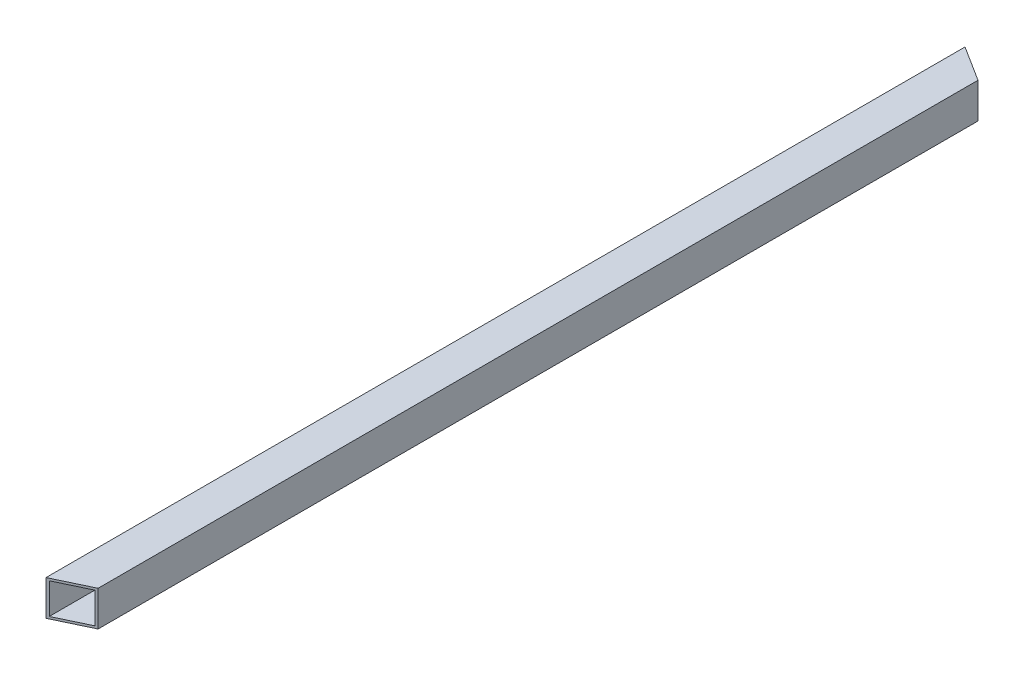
ISO-10303-21;
HEADER;
FILE_DESCRIPTION(('STEP AP214'),'2;1');
FILE_NAME('part.step','',(''),(''),'','','');
FILE_SCHEMA(('AUTOMOTIVE_DESIGN { 1 0 10303 214 1 1 1 1 }'));
ENDSEC;
DATA;
#1=APPLICATION_CONTEXT('core data for automotive mechanical design processes');
#2=APPLICATION_PROTOCOL_DEFINITION('international standard','automotive_design',2000,#1);
#3=PRODUCT_CONTEXT('',#1,'mechanical');
#4=PRODUCT('Part','Part','',(#3));
#5=PRODUCT_RELATED_PRODUCT_CATEGORY('part','',(#4));
#6=PRODUCT_DEFINITION_FORMATION('','',#4);
#7=PRODUCT_DEFINITION_CONTEXT('part definition',#1,'design');
#8=PRODUCT_DEFINITION('design','',#6,#7);
#9=PRODUCT_DEFINITION_SHAPE('','',#8);
#10=(LENGTH_UNIT() NAMED_UNIT(*) SI_UNIT(.MILLI.,.METRE.));
#11=(NAMED_UNIT(*) PLANE_ANGLE_UNIT() SI_UNIT($,.RADIAN.));
#12=(NAMED_UNIT(*) SI_UNIT($,.STERADIAN.) SOLID_ANGLE_UNIT());
#13=UNCERTAINTY_MEASURE_WITH_UNIT(LENGTH_MEASURE(1.E-05),#10,'distance_accuracy_value','');
#14=(GEOMETRIC_REPRESENTATION_CONTEXT(3) GLOBAL_UNCERTAINTY_ASSIGNED_CONTEXT((#13)) GLOBAL_UNIT_ASSIGNED_CONTEXT((#10,
#11,#12)) REPRESENTATION_CONTEXT('',''));
#15=CARTESIAN_POINT('',(0.,0.,0.));
#16=DIRECTION('',(0.,0.,1.));
#17=DIRECTION('',(1.,0.,0.));
#18=AXIS2_PLACEMENT_3D('',#15,#16,#17);
#19=CARTESIAN_POINT('',(0.,0.,2677.0203));
#20=DIRECTION('',(1.,0.,0.));
#21=DIRECTION('',(0.,0.,-1.));
#22=AXIS2_PLACEMENT_3D('',#19,#20,#21);
#23=PLANE('',#22);
#24=DIRECTION('',(0.,0.,-1.));
#25=VECTOR('',#24,1.);
#26=CARTESIAN_POINT('',(0.,0.,2677.0203));
#27=LINE('',#26,#25);
#28=CARTESIAN_POINT('',(1.11022302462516E-13,0.,1322.11483273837));
#29=VERTEX_POINT('',#28);
#30=CARTESIAN_POINT('',(0.,0.,0.));
#31=VERTEX_POINT('',#30);
#32=EDGE_CURVE('E105',#29,#31,#27,.T.);
#33=ORIENTED_EDGE('',*,*,#32,.F.);
#34=DIRECTION('',(0.,1.,0.));
#35=VECTOR('',#34,1.);
#36=CARTESIAN_POINT('',(0.,0.,1322.11483273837));
#37=LINE('',#36,#35);
#38=CARTESIAN_POINT('',(1.11022302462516E-13,50.8,1322.11483273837));
#39=VERTEX_POINT('',#38);
#40=EDGE_CURVE('E93',#29,#39,#37,.T.);
#41=ORIENTED_EDGE('',*,*,#40,.T.);
#42=DIRECTION('',(0.,0.,-1.));
#43=VECTOR('',#42,1.);
#44=CARTESIAN_POINT('',(0.,50.8,2677.0203));
#45=LINE('',#44,#43);
#46=CARTESIAN_POINT('',(0.,50.8,0.));
#47=VERTEX_POINT('',#46);
#48=EDGE_CURVE('E103',#39,#47,#45,.T.);
#49=ORIENTED_EDGE('',*,*,#48,.T.);
#50=DIRECTION('',(0.,-1.,0.));
#51=VECTOR('',#50,1.);
#52=CARTESIAN_POINT('',(0.,0.,0.));
#53=LINE('',#52,#51);
#54=EDGE_CURVE('E113',#47,#31,#53,.T.);
#55=ORIENTED_EDGE('',*,*,#54,.T.);
#56=EDGE_LOOP('',(#33,#41,#49,#55));
#57=FACE_BOUND('',#56,.T.);
#58=ADVANCED_FACE('F30',(#57),#23,.F.);
#59=CARTESIAN_POINT('',(0.,0.,2677.0203));
#60=DIRECTION('',(0.,1.,0.));
#61=DIRECTION('',(0.,0.,1.));
#62=AXIS2_PLACEMENT_3D('',#59,#60,#61);
#63=PLANE('',#62);
#64=DIRECTION('',(0.,0.,-1.));
#65=VECTOR('',#64,1.);
#66=CARTESIAN_POINT('',(50.8,0.,2677.0203));
#67=LINE('',#66,#65);
#68=CARTESIAN_POINT('',(50.8,0.,1297.98144591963));
#69=VERTEX_POINT('',#68);
#70=CARTESIAN_POINT('',(50.8000000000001,0.,32.1077045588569));
#71=VERTEX_POINT('',#70);
#72=EDGE_CURVE('E115',#69,#71,#67,.T.);
#73=ORIENTED_EDGE('',*,*,#72,.F.);
#74=DIRECTION('',(-0.903254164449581,0.,0.429105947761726));
#75=VECTOR('',#74,1.);
#76=CARTESIAN_POINT('',(148.511746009,0.,1251.56185215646));
#77=LINE('',#76,#75);
#78=EDGE_CURVE('E98',#69,#29,#77,.T.);
#79=ORIENTED_EDGE('',*,*,#78,.T.);
#80=ORIENTED_EDGE('',*,*,#32,.T.);
#81=DIRECTION('',(-0.845312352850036,0.,-0.534272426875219));
#82=VECTOR('',#81,1.);
#83=CARTESIAN_POINT('',(0.,0.,0.));
#84=LINE('',#83,#82);
#85=EDGE_CURVE('E106',#71,#31,#84,.T.);
#86=ORIENTED_EDGE('',*,*,#85,.F.);
#87=EDGE_LOOP('',(#73,#79,#80,#86));
#88=FACE_BOUND('',#87,.T.);
#89=ADVANCED_FACE('F173',(#88),#63,.F.);
#90=CARTESIAN_POINT('',(50.8,0.,2677.0203));
#91=DIRECTION('',(-1.,0.,0.));
#92=DIRECTION('',(0.,-1.,0.));
#93=AXIS2_PLACEMENT_3D('',#90,#91,#92);
#94=PLANE('',#93);
#95=DIRECTION('',(0.,0.,-1.));
#96=VECTOR('',#95,1.);
#97=CARTESIAN_POINT('',(50.8,50.8,2677.0203));
#98=LINE('',#97,#96);
#99=CARTESIAN_POINT('',(50.8,50.8,1297.98144591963));
#100=VERTEX_POINT('',#99);
#101=CARTESIAN_POINT('',(50.7999999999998,50.8,32.1077045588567));
#102=VERTEX_POINT('',#101);
#103=EDGE_CURVE('E112',#100,#102,#98,.T.);
#104=ORIENTED_EDGE('',*,*,#103,.F.);
#105=DIRECTION('',(0.,-1.,0.));
#106=VECTOR('',#105,1.);
#107=CARTESIAN_POINT('',(50.8,3.57946063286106E-13,1297.98144591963));
#108=LINE('',#107,#106);
#109=EDGE_CURVE('E44',#100,#69,#108,.T.);
#110=ORIENTED_EDGE('',*,*,#109,.T.);
#111=ORIENTED_EDGE('',*,*,#72,.T.);
#112=DIRECTION('',(0.,1.,0.));
#113=VECTOR('',#112,1.);
#114=CARTESIAN_POINT('',(50.8,-9.13362962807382E-13,32.1077045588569));
#115=LINE('',#114,#113);
#116=EDGE_CURVE('E142',#71,#102,#115,.T.);
#117=ORIENTED_EDGE('',*,*,#116,.T.);
#118=EDGE_LOOP('',(#104,#110,#111,#117));
#119=FACE_BOUND('',#118,.T.);
#120=ADVANCED_FACE('F176',(#119),#94,.F.);
#121=CARTESIAN_POINT('',(0.,50.8,2677.0203));
#122=DIRECTION('',(0.,-1.,0.));
#123=DIRECTION('',(0.,0.,-1.));
#124=AXIS2_PLACEMENT_3D('',#121,#122,#123);
#125=PLANE('',#124);
#126=ORIENTED_EDGE('',*,*,#48,.F.);
#127=DIRECTION('',(-0.903254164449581,0.,0.429105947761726));
#128=VECTOR('',#127,1.);
#129=CARTESIAN_POINT('',(148.511746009,50.8,1251.56185215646));
#130=LINE('',#129,#128);
#131=EDGE_CURVE('E90',#100,#39,#130,.T.);
#132=ORIENTED_EDGE('',*,*,#131,.F.);
#133=ORIENTED_EDGE('',*,*,#103,.T.);
#134=DIRECTION('',(-0.845312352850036,0.,-0.534272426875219));
#135=VECTOR('',#134,1.);
#136=CARTESIAN_POINT('',(0.,50.8,0.));
#137=LINE('',#136,#135);
#138=EDGE_CURVE('E111',#102,#47,#137,.T.);
#139=ORIENTED_EDGE('',*,*,#138,.T.);
#140=EDGE_LOOP('',(#126,#132,#133,#139));
#141=FACE_BOUND('',#140,.T.);
#142=ADVANCED_FACE('F109',(#141),#125,.F.);
#143=CARTESIAN_POINT('',(3.175,3.175,2677.0203));
#144=DIRECTION('',(1.,0.,0.));
#145=DIRECTION('',(0.,0.,-1.));
#146=AXIS2_PLACEMENT_3D('',#143,#144,#145);
#147=PLANE('',#146);
#148=DIRECTION('',(0.,1.,0.));
#149=VECTOR('',#148,1.);
#150=CARTESIAN_POINT('',(3.175,3.175,1320.6064960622));
#151=LINE('',#150,#149);
#152=CARTESIAN_POINT('',(3.17500000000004,3.175,1320.60649606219));
#153=VERTEX_POINT('',#152);
#154=CARTESIAN_POINT('',(3.17500000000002,47.625,1320.60649606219));
#155=VERTEX_POINT('',#154);
#156=EDGE_CURVE('E51',#153,#155,#151,.T.);
#157=ORIENTED_EDGE('',*,*,#156,.F.);
#158=DIRECTION('',(0.,0.,-1.));
#159=VECTOR('',#158,1.);
#160=CARTESIAN_POINT('',(3.175,3.175,2677.0203));
#161=LINE('',#160,#159);
#162=CARTESIAN_POINT('',(3.17499999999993,3.175,2.00673153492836));
#163=VERTEX_POINT('',#162);
#164=EDGE_CURVE('E117',#153,#163,#161,.T.);
#165=ORIENTED_EDGE('',*,*,#164,.T.);
#166=DIRECTION('',(0.,-1.,0.));
#167=VECTOR('',#166,1.);
#168=CARTESIAN_POINT('',(3.175,3.175,2.00673153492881));
#169=LINE('',#168,#167);
#170=CARTESIAN_POINT('',(3.17499999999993,47.625,2.00673153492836));
#171=VERTEX_POINT('',#170);
#172=EDGE_CURVE('E131',#171,#163,#169,.T.);
#173=ORIENTED_EDGE('',*,*,#172,.F.);
#174=DIRECTION('',(0.,0.,-1.));
#175=VECTOR('',#174,1.);
#176=CARTESIAN_POINT('',(3.175,47.625,2677.0203));
#177=LINE('',#176,#175);
#178=EDGE_CURVE('E140',#155,#171,#177,.T.);
#179=ORIENTED_EDGE('',*,*,#178,.F.);
#180=EDGE_LOOP('',(#157,#165,#173,#179));
#181=FACE_BOUND('',#180,.T.);
#182=ADVANCED_FACE('F139',(#181),#147,.T.);
#183=CARTESIAN_POINT('',(3.175,3.175,2677.0203));
#184=DIRECTION('',(0.,1.,0.));
#185=DIRECTION('',(0.,0.,1.));
#186=AXIS2_PLACEMENT_3D('',#183,#184,#185);
#187=PLANE('',#186);
#188=DIRECTION('',(-0.903254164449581,0.,0.429105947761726));
#189=VECTOR('',#188,1.);
#190=CARTESIAN_POINT('',(-522.559778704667,3.175,1570.36556650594));
#191=LINE('',#190,#189);
#192=CARTESIAN_POINT('',(47.625,3.175,1299.4897825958));
#193=VERTEX_POINT('',#192);
#194=EDGE_CURVE('E158',#193,#153,#191,.T.);
#195=ORIENTED_EDGE('',*,*,#194,.F.);
#196=DIRECTION('',(0.,0.,-1.));
#197=VECTOR('',#196,1.);
#198=CARTESIAN_POINT('',(47.625,3.175,2677.0203));
#199=LINE('',#198,#197);
#200=CARTESIAN_POINT('',(47.625,3.175,30.1009730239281));
#201=VERTEX_POINT('',#200);
#202=EDGE_CURVE('E153',#193,#201,#199,.T.);
#203=ORIENTED_EDGE('',*,*,#202,.T.);
#204=DIRECTION('',(0.845312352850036,0.,0.534272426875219));
#205=VECTOR('',#204,1.);
#206=CARTESIAN_POINT('',(1211.2835728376,3.175,765.581399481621));
#207=LINE('',#206,#205);
#208=EDGE_CURVE('E143',#163,#201,#207,.T.);
#209=ORIENTED_EDGE('',*,*,#208,.F.);
#210=ORIENTED_EDGE('',*,*,#164,.F.);
#211=EDGE_LOOP('',(#195,#203,#209,#210));
#212=FACE_BOUND('',#211,.T.);
#213=ADVANCED_FACE('F157',(#212),#187,.T.);
#214=CARTESIAN_POINT('',(47.625,3.175,2677.0203));
#215=DIRECTION('',(-1.,0.,0.));
#216=DIRECTION('',(0.,-1.,0.));
#217=AXIS2_PLACEMENT_3D('',#214,#215,#216);
#218=PLANE('',#217);
#219=DIRECTION('',(0.,-1.,0.));
#220=VECTOR('',#219,1.);
#221=CARTESIAN_POINT('',(47.625,3.1750000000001,1299.4897825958));
#222=LINE('',#221,#220);
#223=CARTESIAN_POINT('',(47.625,47.625,1299.4897825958));
#224=VERTEX_POINT('',#223);
#225=EDGE_CURVE('E169',#224,#193,#222,.T.);
#226=ORIENTED_EDGE('',*,*,#225,.F.);
#227=DIRECTION('',(0.,0.,-1.));
#228=VECTOR('',#227,1.);
#229=CARTESIAN_POINT('',(47.625,47.625,2677.0203));
#230=LINE('',#229,#228);
#231=CARTESIAN_POINT('',(47.625,47.625,30.1009730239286));
#232=VERTEX_POINT('',#231);
#233=EDGE_CURVE('E151',#224,#232,#230,.T.);
#234=ORIENTED_EDGE('',*,*,#233,.T.);
#235=DIRECTION('',(0.,1.,0.));
#236=VECTOR('',#235,1.);
#237=CARTESIAN_POINT('',(47.625,3.17499999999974,30.1009730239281));
#238=LINE('',#237,#236);
#239=EDGE_CURVE('E134',#201,#232,#238,.T.);
#240=ORIENTED_EDGE('',*,*,#239,.F.);
#241=ORIENTED_EDGE('',*,*,#202,.F.);
#242=EDGE_LOOP('',(#226,#234,#240,#241));
#243=FACE_BOUND('',#242,.T.);
#244=ADVANCED_FACE('F161',(#243),#218,.T.);
#245=CARTESIAN_POINT('',(3.175,47.625,2677.0203));
#246=DIRECTION('',(0.,-1.,0.));
#247=DIRECTION('',(0.,0.,-1.));
#248=AXIS2_PLACEMENT_3D('',#245,#246,#247);
#249=PLANE('',#248);
#250=DIRECTION('',(0.903254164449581,0.,-0.429105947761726));
#251=VECTOR('',#250,1.);
#252=CARTESIAN_POINT('',(-522.559778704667,47.625,1570.36556650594));
#253=LINE('',#252,#251);
#254=EDGE_CURVE('E11',#155,#224,#253,.T.);
#255=ORIENTED_EDGE('',*,*,#254,.F.);
#256=ORIENTED_EDGE('',*,*,#178,.T.);
#257=DIRECTION('',(-0.845312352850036,0.,-0.534272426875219));
#258=VECTOR('',#257,1.);
#259=CARTESIAN_POINT('',(1211.2835728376,47.625,765.581399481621));
#260=LINE('',#259,#258);
#261=EDGE_CURVE('E37',#232,#171,#260,.T.);
#262=ORIENTED_EDGE('',*,*,#261,.F.);
#263=ORIENTED_EDGE('',*,*,#233,.F.);
#264=EDGE_LOOP('',(#255,#256,#262,#263));
#265=FACE_BOUND('',#264,.T.);
#266=ADVANCED_FACE('F179',(#265),#249,.T.);
#267=CARTESIAN_POINT('',(0.,50.8,0.));
#268=DIRECTION('',(-0.534272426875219,0.,0.845312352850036));
#269=DIRECTION('',(0.845312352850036,0.,0.534272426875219));
#270=AXIS2_PLACEMENT_3D('',#267,#268,#269);
#271=PLANE('',#270);
#272=ORIENTED_EDGE('',*,*,#172,.T.);
#273=ORIENTED_EDGE('',*,*,#208,.T.);
#274=ORIENTED_EDGE('',*,*,#239,.T.);
#275=ORIENTED_EDGE('',*,*,#261,.T.);
#276=EDGE_LOOP('',(#272,#273,#274,#275));
#277=FACE_BOUND('',#276,.T.);
#278=ORIENTED_EDGE('',*,*,#85,.T.);
#279=ORIENTED_EDGE('',*,*,#54,.F.);
#280=ORIENTED_EDGE('',*,*,#138,.F.);
#281=ORIENTED_EDGE('',*,*,#116,.F.);
#282=EDGE_LOOP('',(#278,#279,#280,#281));
#283=FACE_BOUND('',#282,.T.);
#284=ADVANCED_FACE('F128',(#277,#283),#271,.F.);
#285=CARTESIAN_POINT('',(148.511746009,0.,1251.56185215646));
#286=DIRECTION('',(-0.429105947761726,0.,-0.903254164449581));
#287=DIRECTION('',(-0.903254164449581,0.,0.429105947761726));
#288=AXIS2_PLACEMENT_3D('',#285,#286,#287);
#289=PLANE('',#288);
#290=ORIENTED_EDGE('',*,*,#156,.T.);
#291=ORIENTED_EDGE('',*,*,#254,.T.);
#292=ORIENTED_EDGE('',*,*,#225,.T.);
#293=ORIENTED_EDGE('',*,*,#194,.T.);
#294=EDGE_LOOP('',(#290,#291,#292,#293));
#295=FACE_BOUND('',#294,.T.);
#296=ORIENTED_EDGE('',*,*,#78,.F.);
#297=ORIENTED_EDGE('',*,*,#109,.F.);
#298=ORIENTED_EDGE('',*,*,#131,.T.);
#299=ORIENTED_EDGE('',*,*,#40,.F.);
#300=EDGE_LOOP('',(#296,#297,#298,#299));
#301=FACE_BOUND('',#300,.T.);
#302=ADVANCED_FACE('F92',(#295,#301),#289,.F.);
#303=CLOSED_SHELL('',(#58,#89,#120,#142,#182,#213,#244,#266,#284,#302));
#304=MANIFOLD_SOLID_BREP('B2',#303);
#305=ADVANCED_BREP_SHAPE_REPRESENTATION('',(#18,#304),#14);
#306=SHAPE_DEFINITION_REPRESENTATION(#9,#305);
ENDSEC;
END-ISO-10303-21;
